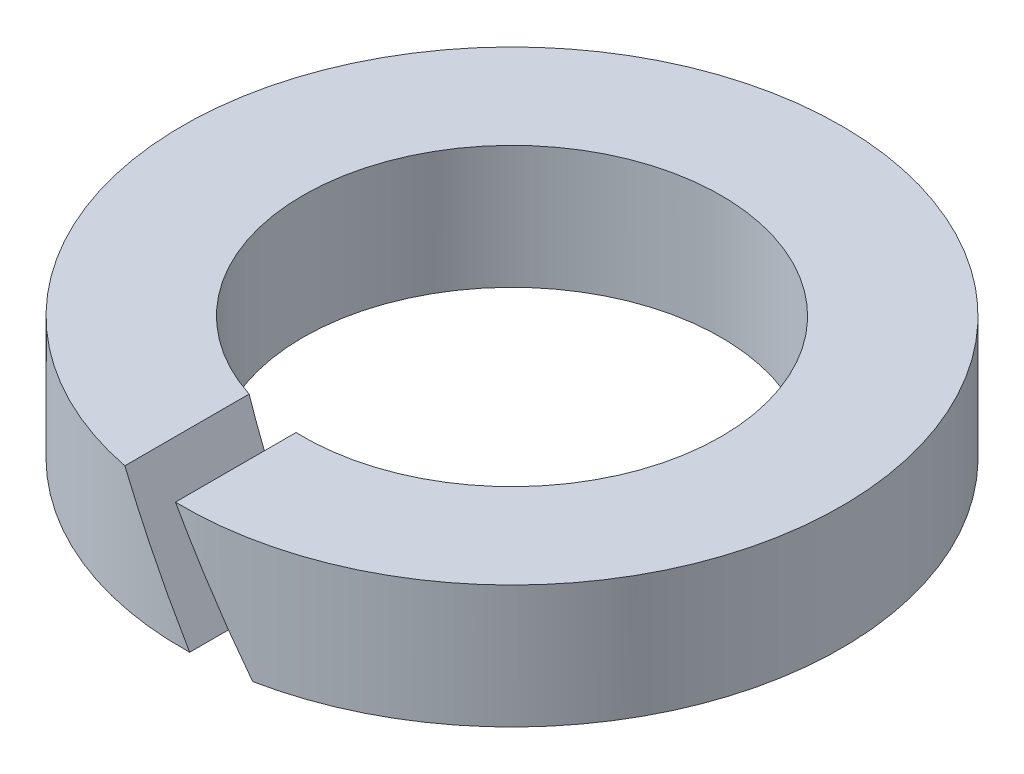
from build123d import *

# Parameters (mm, degrees)
SECTION_2_W      = 2.45
SECTION_2_H      = 2.5
FENTE_REACH      = 11.654
FENTE_END_RADIUS = 6.7


with BuildPart() as part:
    # section 2 → R_volution (revolve)
    with BuildSketch(Plane.XY, mode=Mode.PRIVATE) as r_volution_sk:
        with Locations((5.475, 0)):
            Rectangle(SECTION_2_W, SECTION_2_H)
    revolve(r_volution_sk.sketch.rotate(Axis((0, 80, 0), (0, -1, 0)), 90), axis=Axis((0, 80, 0), (0, -1, 0)))

    # fente: up to this cylinder (the profile starts inside it)
    fente_end = Plane(origin=(0, 0, 0), z_dir=(0, 1, 0)) * Cylinder(FENTE_END_RADIUS, 37.708, mode=Mode.PRIVATE)
    # Sketch2 → fente (cut, up to the surface)
    with BuildSketch(Plane(origin=(0, 0.6, 0), x_dir=(-1, 0, 0), z_dir=(0, 0, -1)), mode=Mode.PRIVATE) as fente_sk1:
        Polygon((-1.299038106, -1.85), (0.144337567, 0.65), (1.299038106, 0.65), (-0.144337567, -1.85), align=None)
    fente_tool1 = extrude(fente_sk1.sketch, amount=-FENTE_REACH, mode=Mode.PRIVATE) & fente_end
    add(fente_tool1.solids().sort_by_distance((0, 0, 0))[0], mode=Mode.SUBTRACT)


solid = part.part
